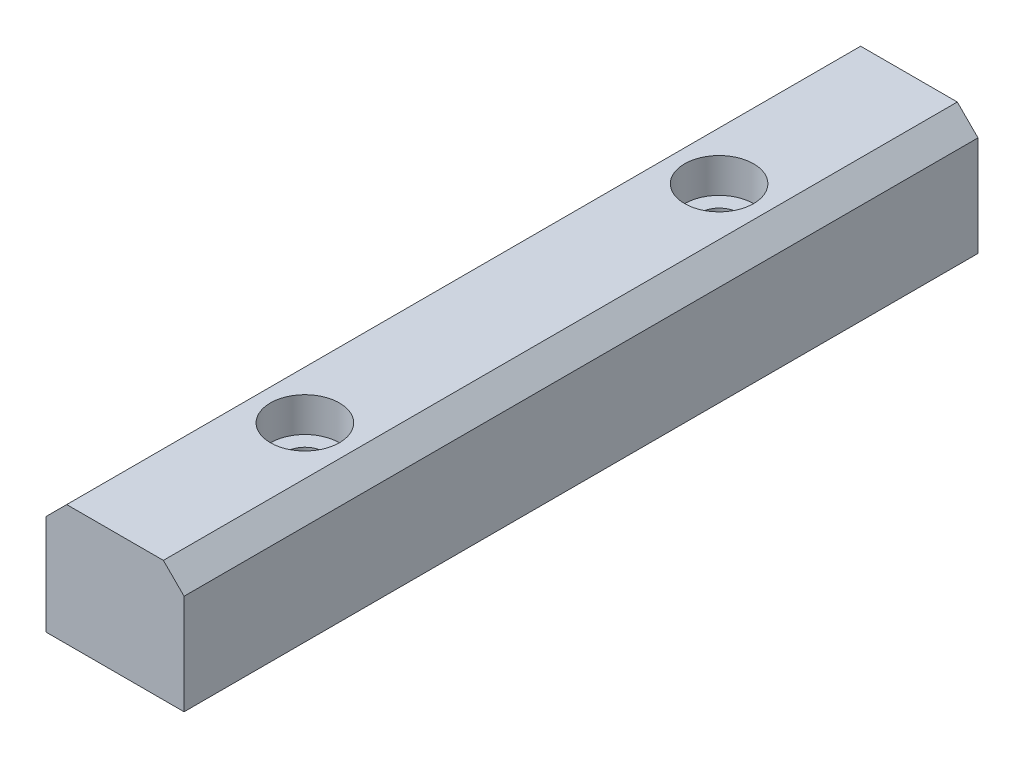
ISO-10303-21;
HEADER;
FILE_DESCRIPTION(('STEP AP214'),'2;1');
FILE_NAME('part.step','',(''),(''),'','','');
FILE_SCHEMA(('AUTOMOTIVE_DESIGN { 1 0 10303 214 1 1 1 1 }'));
ENDSEC;
DATA;
#1=APPLICATION_CONTEXT('core data for automotive mechanical design processes');
#2=APPLICATION_PROTOCOL_DEFINITION('international standard','automotive_design',2000,#1);
#3=PRODUCT_CONTEXT('',#1,'mechanical');
#4=PRODUCT('Part','Part','',(#3));
#5=PRODUCT_RELATED_PRODUCT_CATEGORY('part','',(#4));
#6=PRODUCT_DEFINITION_FORMATION('','',#4);
#7=PRODUCT_DEFINITION_CONTEXT('part definition',#1,'design');
#8=PRODUCT_DEFINITION('design','',#6,#7);
#9=PRODUCT_DEFINITION_SHAPE('','',#8);
#10=(LENGTH_UNIT() NAMED_UNIT(*) SI_UNIT(.MILLI.,.METRE.));
#11=(NAMED_UNIT(*) PLANE_ANGLE_UNIT() SI_UNIT($,.RADIAN.));
#12=(NAMED_UNIT(*) SI_UNIT($,.STERADIAN.) SOLID_ANGLE_UNIT());
#13=UNCERTAINTY_MEASURE_WITH_UNIT(LENGTH_MEASURE(1.E-05),#10,'distance_accuracy_value','');
#14=(GEOMETRIC_REPRESENTATION_CONTEXT(3) GLOBAL_UNCERTAINTY_ASSIGNED_CONTEXT((#13)) GLOBAL_UNIT_ASSIGNED_CONTEXT((#10,
#11,#12)) REPRESENTATION_CONTEXT('',''));
#15=CARTESIAN_POINT('',(0.,0.,0.));
#16=DIRECTION('',(0.,0.,1.));
#17=DIRECTION('',(1.,0.,0.));
#18=AXIS2_PLACEMENT_3D('',#15,#16,#17);
#19=CARTESIAN_POINT('',(-10.,17.5,-57.5));
#20=DIRECTION('',(1.,0.,0.));
#21=DIRECTION('',(0.,0.,-1.));
#22=AXIS2_PLACEMENT_3D('',#19,#20,#21);
#23=PLANE('',#22);
#24=DIRECTION('',(0.,-1.,0.));
#25=VECTOR('',#24,1.);
#26=CARTESIAN_POINT('',(-9.99999999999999,17.5,57.5));
#27=LINE('',#26,#25);
#28=CARTESIAN_POINT('',(-9.99999999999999,14.5,57.5));
#29=VERTEX_POINT('',#28);
#30=CARTESIAN_POINT('',(-9.99999999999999,0.,57.5));
#31=VERTEX_POINT('',#30);
#32=EDGE_CURVE('E83',#29,#31,#27,.T.);
#33=ORIENTED_EDGE('',*,*,#32,.F.);
#34=DIRECTION('',(0.,0.,-1.));
#35=VECTOR('',#34,1.);
#36=CARTESIAN_POINT('',(-10.,14.5,-57.5));
#37=LINE('',#36,#35);
#38=CARTESIAN_POINT('',(-10.,14.5,-57.5));
#39=VERTEX_POINT('',#38);
#40=EDGE_CURVE('E54',#29,#39,#37,.T.);
#41=ORIENTED_EDGE('',*,*,#40,.T.);
#42=DIRECTION('',(0.,-1.,0.));
#43=VECTOR('',#42,1.);
#44=CARTESIAN_POINT('',(-10.,17.5,-57.5));
#45=LINE('',#44,#43);
#46=CARTESIAN_POINT('',(-10.,0.,-57.5));
#47=VERTEX_POINT('',#46);
#48=EDGE_CURVE('E103',#39,#47,#45,.T.);
#49=ORIENTED_EDGE('',*,*,#48,.T.);
#50=DIRECTION('',(0.,0.,1.));
#51=VECTOR('',#50,1.);
#52=CARTESIAN_POINT('',(-10.,0.,-57.5));
#53=LINE('',#52,#51);
#54=EDGE_CURVE('E99',#47,#31,#53,.T.);
#55=ORIENTED_EDGE('',*,*,#54,.T.);
#56=EDGE_LOOP('',(#33,#41,#49,#55));
#57=FACE_BOUND('',#56,.T.);
#58=ADVANCED_FACE('F31',(#57),#23,.F.);
#59=CARTESIAN_POINT('',(-9.99999999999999,17.5,57.5));
#60=DIRECTION('',(0.,0.,-1.));
#61=DIRECTION('',(-1.,0.,0.));
#62=AXIS2_PLACEMENT_3D('',#59,#60,#61);
#63=PLANE('',#62);
#64=DIRECTION('',(1.,0.,0.));
#65=VECTOR('',#64,1.);
#66=CARTESIAN_POINT('',(-9.99999999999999,17.5,57.5));
#67=LINE('',#66,#65);
#68=CARTESIAN_POINT('',(-7.00000000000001,17.5,57.5));
#69=VERTEX_POINT('',#68);
#70=CARTESIAN_POINT('',(7.,17.5,57.5));
#71=VERTEX_POINT('',#70);
#72=EDGE_CURVE('E117',#69,#71,#67,.T.);
#73=ORIENTED_EDGE('',*,*,#72,.F.);
#74=DIRECTION('',(-0.707106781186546,-0.707106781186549,0.));
#75=VECTOR('',#74,1.);
#76=CARTESIAN_POINT('',(-7.00000000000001,17.5,57.5));
#77=LINE('',#76,#75);
#78=EDGE_CURVE('E90',#69,#29,#77,.T.);
#79=ORIENTED_EDGE('',*,*,#78,.T.);
#80=ORIENTED_EDGE('',*,*,#32,.T.);
#81=DIRECTION('',(1.,0.,0.));
#82=VECTOR('',#81,1.);
#83=CARTESIAN_POINT('',(-9.99999999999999,0.,57.5));
#84=LINE('',#83,#82);
#85=CARTESIAN_POINT('',(10.,0.,57.5));
#86=VERTEX_POINT('',#85);
#87=EDGE_CURVE('E88',#31,#86,#84,.T.);
#88=ORIENTED_EDGE('',*,*,#87,.T.);
#89=DIRECTION('',(0.,-1.,0.));
#90=VECTOR('',#89,1.);
#91=CARTESIAN_POINT('',(10.,17.5,57.5));
#92=LINE('',#91,#90);
#93=CARTESIAN_POINT('',(10.,14.5,57.5));
#94=VERTEX_POINT('',#93);
#95=EDGE_CURVE('E93',#94,#86,#92,.T.);
#96=ORIENTED_EDGE('',*,*,#95,.F.);
#97=DIRECTION('',(-0.707106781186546,0.707106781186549,0.));
#98=VECTOR('',#97,1.);
#99=CARTESIAN_POINT('',(7.,17.5,57.5));
#100=LINE('',#99,#98);
#101=EDGE_CURVE('E127',#94,#71,#100,.T.);
#102=ORIENTED_EDGE('',*,*,#101,.T.);
#103=EDGE_LOOP('',(#73,#79,#80,#88,#96,#102));
#104=FACE_BOUND('',#103,.T.);
#105=ADVANCED_FACE('F86',(#104),#63,.F.);
#106=CARTESIAN_POINT('',(9.99999999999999,17.5,-57.5));
#107=DIRECTION('',(-1.,0.,0.));
#108=DIRECTION('',(0.,0.,1.));
#109=AXIS2_PLACEMENT_3D('',#106,#107,#108);
#110=PLANE('',#109);
#111=DIRECTION('',(0.,-1.,0.));
#112=VECTOR('',#111,1.);
#113=CARTESIAN_POINT('',(9.99999999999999,17.5,-57.5));
#114=LINE('',#113,#112);
#115=CARTESIAN_POINT('',(9.99999999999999,14.5,-57.5));
#116=VERTEX_POINT('',#115);
#117=CARTESIAN_POINT('',(9.99999999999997,0.,-57.5));
#118=VERTEX_POINT('',#117);
#119=EDGE_CURVE('E119',#116,#118,#114,.T.);
#120=ORIENTED_EDGE('',*,*,#119,.F.);
#121=DIRECTION('',(0.,0.,1.));
#122=VECTOR('',#121,1.);
#123=CARTESIAN_POINT('',(10.,14.5,57.5));
#124=LINE('',#123,#122);
#125=EDGE_CURVE('E11',#116,#94,#124,.T.);
#126=ORIENTED_EDGE('',*,*,#125,.T.);
#127=ORIENTED_EDGE('',*,*,#95,.T.);
#128=DIRECTION('',(0.,0.,-1.));
#129=VECTOR('',#128,1.);
#130=CARTESIAN_POINT('',(9.99999999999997,0.,-57.5));
#131=LINE('',#130,#129);
#132=EDGE_CURVE('E101',#86,#118,#131,.T.);
#133=ORIENTED_EDGE('',*,*,#132,.T.);
#134=EDGE_LOOP('',(#120,#126,#127,#133));
#135=FACE_BOUND('',#134,.T.);
#136=ADVANCED_FACE('F156',(#135),#110,.F.);
#137=CARTESIAN_POINT('',(-10.,17.5,-57.5));
#138=DIRECTION('',(0.,0.,1.));
#139=DIRECTION('',(1.,0.,0.));
#140=AXIS2_PLACEMENT_3D('',#137,#138,#139);
#141=PLANE('',#140);
#142=ORIENTED_EDGE('',*,*,#48,.F.);
#143=DIRECTION('',(0.707106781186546,0.707106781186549,0.));
#144=VECTOR('',#143,1.);
#145=CARTESIAN_POINT('',(-7.00000000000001,17.5,-57.5));
#146=LINE('',#145,#144);
#147=CARTESIAN_POINT('',(-7.00000000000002,17.5,-57.5));
#148=VERTEX_POINT('',#147);
#149=EDGE_CURVE('E39',#39,#148,#146,.T.);
#150=ORIENTED_EDGE('',*,*,#149,.T.);
#151=DIRECTION('',(-1.,0.,0.));
#152=VECTOR('',#151,1.);
#153=CARTESIAN_POINT('',(-10.,17.5,-57.5));
#154=LINE('',#153,#152);
#155=CARTESIAN_POINT('',(6.99999999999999,17.5,-57.5));
#156=VERTEX_POINT('',#155);
#157=EDGE_CURVE('E111',#156,#148,#154,.T.);
#158=ORIENTED_EDGE('',*,*,#157,.F.);
#159=DIRECTION('',(0.707106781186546,-0.707106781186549,0.));
#160=VECTOR('',#159,1.);
#161=CARTESIAN_POINT('',(7.,17.5,-57.5));
#162=LINE('',#161,#160);
#163=EDGE_CURVE('E46',#156,#116,#162,.T.);
#164=ORIENTED_EDGE('',*,*,#163,.T.);
#165=ORIENTED_EDGE('',*,*,#119,.T.);
#166=DIRECTION('',(-1.,0.,0.));
#167=VECTOR('',#166,1.);
#168=CARTESIAN_POINT('',(-10.,0.,-57.5));
#169=LINE('',#168,#167);
#170=EDGE_CURVE('E115',#118,#47,#169,.T.);
#171=ORIENTED_EDGE('',*,*,#170,.T.);
#172=EDGE_LOOP('',(#142,#150,#158,#164,#165,#171));
#173=FACE_BOUND('',#172,.T.);
#174=ADVANCED_FACE('F133',(#173),#141,.F.);
#175=CARTESIAN_POINT('',(-9.99999999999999,17.5,57.5));
#176=DIRECTION('',(0.,1.,0.));
#177=DIRECTION('',(0.,0.,1.));
#178=AXIS2_PLACEMENT_3D('',#175,#176,#177);
#179=PLANE('',#178);
#180=CARTESIAN_POINT('',(0.,17.5,30.));
#181=DIRECTION('',(0.,1.,0.));
#182=DIRECTION('',(0.,0.,1.));
#183=AXIS2_PLACEMENT_3D('',#180,#181,#182);
#184=CIRCLE('',#183,4.99999999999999);
#185=CARTESIAN_POINT('',(0.,17.5,35.));
#186=VERTEX_POINT('',#185);
#187=EDGE_CURVE('E197',#186,#186,#184,.T.);
#188=ORIENTED_EDGE('',*,*,#187,.F.);
#189=EDGE_LOOP('',(#188));
#190=FACE_BOUND('',#189,.T.);
#191=CARTESIAN_POINT('',(0.,17.5,-30.));
#192=DIRECTION('',(0.,1.,0.));
#193=DIRECTION('',(0.,0.,1.));
#194=AXIS2_PLACEMENT_3D('',#191,#192,#193);
#195=CIRCLE('',#194,4.99999999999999);
#196=CARTESIAN_POINT('',(0.,17.5,-25.));
#197=VERTEX_POINT('',#196);
#198=EDGE_CURVE('E206',#197,#197,#195,.T.);
#199=ORIENTED_EDGE('',*,*,#198,.F.);
#200=EDGE_LOOP('',(#199));
#201=FACE_BOUND('',#200,.T.);
#202=ORIENTED_EDGE('',*,*,#157,.T.);
#203=DIRECTION('',(0.,0.,1.));
#204=VECTOR('',#203,1.);
#205=CARTESIAN_POINT('',(-7.00000000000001,17.5,57.5));
#206=LINE('',#205,#204);
#207=EDGE_CURVE('E124',#148,#69,#206,.T.);
#208=ORIENTED_EDGE('',*,*,#207,.T.);
#209=ORIENTED_EDGE('',*,*,#72,.T.);
#210=DIRECTION('',(0.,0.,-1.));
#211=VECTOR('',#210,1.);
#212=CARTESIAN_POINT('',(6.99999999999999,17.5,-57.5));
#213=LINE('',#212,#211);
#214=EDGE_CURVE('E92',#71,#156,#213,.T.);
#215=ORIENTED_EDGE('',*,*,#214,.T.);
#216=EDGE_LOOP('',(#202,#208,#209,#215));
#217=FACE_BOUND('',#216,.T.);
#218=ADVANCED_FACE('F137',(#190,#201,#217),#179,.T.);
#219=CARTESIAN_POINT('',(-9.99999999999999,0.,57.5));
#220=DIRECTION('',(0.,1.,0.));
#221=DIRECTION('',(0.,0.,1.));
#222=AXIS2_PLACEMENT_3D('',#219,#220,#221);
#223=PLANE('',#222);
#224=CARTESIAN_POINT('',(0.,0.,30.));
#225=DIRECTION('',(0.,1.,0.));
#226=DIRECTION('',(0.,0.,1.));
#227=AXIS2_PLACEMENT_3D('',#224,#225,#226);
#228=CIRCLE('',#227,2.75);
#229=CARTESIAN_POINT('',(0.,0.,32.75));
#230=VERTEX_POINT('',#229);
#231=EDGE_CURVE('E199',#230,#230,#228,.T.);
#232=ORIENTED_EDGE('',*,*,#231,.T.);
#233=EDGE_LOOP('',(#232));
#234=FACE_BOUND('',#233,.T.);
#235=CARTESIAN_POINT('',(0.,0.,-30.));
#236=DIRECTION('',(0.,1.,0.));
#237=DIRECTION('',(0.,0.,1.));
#238=AXIS2_PLACEMENT_3D('',#235,#236,#237);
#239=CIRCLE('',#238,2.75);
#240=CARTESIAN_POINT('',(0.,0.,-27.25));
#241=VERTEX_POINT('',#240);
#242=EDGE_CURVE('E105',#241,#241,#239,.T.);
#243=ORIENTED_EDGE('',*,*,#242,.T.);
#244=EDGE_LOOP('',(#243));
#245=FACE_BOUND('',#244,.T.);
#246=ORIENTED_EDGE('',*,*,#54,.F.);
#247=ORIENTED_EDGE('',*,*,#170,.F.);
#248=ORIENTED_EDGE('',*,*,#132,.F.);
#249=ORIENTED_EDGE('',*,*,#87,.F.);
#250=EDGE_LOOP('',(#246,#247,#248,#249));
#251=FACE_BOUND('',#250,.T.);
#252=ADVANCED_FACE('F97',(#234,#245,#251),#223,.F.);
#253=CARTESIAN_POINT('',(0.,17.5,-30.));
#254=DIRECTION('',(0.,1.,0.));
#255=DIRECTION('',(0.,0.,1.));
#256=AXIS2_PLACEMENT_3D('',#253,#254,#255);
#257=CYLINDRICAL_SURFACE('',#256,2.75);
#258=ORIENTED_EDGE('',*,*,#242,.F.);
#259=EDGE_LOOP('',(#258));
#260=FACE_BOUND('',#259,.T.);
#261=CARTESIAN_POINT('',(0.,12.5,-30.));
#262=DIRECTION('',(0.,1.,0.));
#263=DIRECTION('',(0.,0.,1.));
#264=AXIS2_PLACEMENT_3D('',#261,#262,#263);
#265=CIRCLE('',#264,2.75);
#266=CARTESIAN_POINT('',(0.,12.5,-27.25));
#267=VERTEX_POINT('',#266);
#268=EDGE_CURVE('E108',#267,#267,#265,.T.);
#269=ORIENTED_EDGE('',*,*,#268,.T.);
#270=EDGE_LOOP('',(#269));
#271=FACE_BOUND('',#270,.T.);
#272=ADVANCED_FACE('F166',(#260,#271),#257,.F.);
#273=CARTESIAN_POINT('',(2.75,12.5,-30.));
#274=DIRECTION('',(0.,-1.,0.));
#275=DIRECTION('',(0.,0.,-1.));
#276=AXIS2_PLACEMENT_3D('',#273,#274,#275);
#277=PLANE('',#276);
#278=ORIENTED_EDGE('',*,*,#268,.F.);
#279=EDGE_LOOP('',(#278));
#280=FACE_BOUND('',#279,.T.);
#281=CARTESIAN_POINT('',(0.,12.5,-30.));
#282=DIRECTION('',(0.,1.,0.));
#283=DIRECTION('',(0.,0.,1.));
#284=AXIS2_PLACEMENT_3D('',#281,#282,#283);
#285=CIRCLE('',#284,5.);
#286=CARTESIAN_POINT('',(0.,12.5,-25.));
#287=VERTEX_POINT('',#286);
#288=EDGE_CURVE('E209',#287,#287,#285,.T.);
#289=ORIENTED_EDGE('',*,*,#288,.T.);
#290=EDGE_LOOP('',(#289));
#291=FACE_BOUND('',#290,.T.);
#292=ADVANCED_FACE('F173',(#280,#291),#277,.F.);
#293=CARTESIAN_POINT('',(0.,17.5,-30.));
#294=DIRECTION('',(0.,1.,0.));
#295=DIRECTION('',(0.,0.,1.));
#296=AXIS2_PLACEMENT_3D('',#293,#294,#295);
#297=CYLINDRICAL_SURFACE('',#296,5.);
#298=ORIENTED_EDGE('',*,*,#288,.F.);
#299=EDGE_LOOP('',(#298));
#300=FACE_BOUND('',#299,.T.);
#301=ORIENTED_EDGE('',*,*,#198,.T.);
#302=EDGE_LOOP('',(#301));
#303=FACE_BOUND('',#302,.T.);
#304=ADVANCED_FACE('F177',(#300,#303),#297,.F.);
#305=CARTESIAN_POINT('',(0.,17.5,30.));
#306=DIRECTION('',(0.,1.,0.));
#307=DIRECTION('',(0.,0.,1.));
#308=AXIS2_PLACEMENT_3D('',#305,#306,#307);
#309=CYLINDRICAL_SURFACE('',#308,2.75);
#310=ORIENTED_EDGE('',*,*,#231,.F.);
#311=EDGE_LOOP('',(#310));
#312=FACE_BOUND('',#311,.T.);
#313=CARTESIAN_POINT('',(0.,12.5,30.));
#314=DIRECTION('',(0.,1.,0.));
#315=DIRECTION('',(0.,0.,1.));
#316=AXIS2_PLACEMENT_3D('',#313,#314,#315);
#317=CIRCLE('',#316,2.75);
#318=CARTESIAN_POINT('',(0.,12.5,32.75));
#319=VERTEX_POINT('',#318);
#320=EDGE_CURVE('E193',#319,#319,#317,.T.);
#321=ORIENTED_EDGE('',*,*,#320,.T.);
#322=EDGE_LOOP('',(#321));
#323=FACE_BOUND('',#322,.T.);
#324=ADVANCED_FACE('F181',(#312,#323),#309,.F.);
#325=CARTESIAN_POINT('',(2.75,12.5,30.));
#326=DIRECTION('',(0.,-1.,0.));
#327=DIRECTION('',(0.,0.,-1.));
#328=AXIS2_PLACEMENT_3D('',#325,#326,#327);
#329=PLANE('',#328);
#330=ORIENTED_EDGE('',*,*,#320,.F.);
#331=EDGE_LOOP('',(#330));
#332=FACE_BOUND('',#331,.T.);
#333=CARTESIAN_POINT('',(0.,12.5,30.));
#334=DIRECTION('',(0.,1.,0.));
#335=DIRECTION('',(0.,0.,1.));
#336=AXIS2_PLACEMENT_3D('',#333,#334,#335);
#337=CIRCLE('',#336,5.);
#338=CARTESIAN_POINT('',(0.,12.5,35.));
#339=VERTEX_POINT('',#338);
#340=EDGE_CURVE('E196',#339,#339,#337,.T.);
#341=ORIENTED_EDGE('',*,*,#340,.T.);
#342=EDGE_LOOP('',(#341));
#343=FACE_BOUND('',#342,.T.);
#344=ADVANCED_FACE('F148',(#332,#343),#329,.F.);
#345=CARTESIAN_POINT('',(0.,17.5,30.));
#346=DIRECTION('',(0.,1.,0.));
#347=DIRECTION('',(0.,0.,1.));
#348=AXIS2_PLACEMENT_3D('',#345,#346,#347);
#349=CYLINDRICAL_SURFACE('',#348,5.);
#350=ORIENTED_EDGE('',*,*,#340,.F.);
#351=EDGE_LOOP('',(#350));
#352=FACE_BOUND('',#351,.T.);
#353=ORIENTED_EDGE('',*,*,#187,.T.);
#354=EDGE_LOOP('',(#353));
#355=FACE_BOUND('',#354,.T.);
#356=ADVANCED_FACE('F142',(#352,#355),#349,.F.);
#357=CARTESIAN_POINT('',(-7.00000000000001,17.5,57.5));
#358=DIRECTION('',(-0.707106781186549,0.707106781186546,0.));
#359=DIRECTION('',(-0.707106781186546,-0.707106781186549,0.));
#360=AXIS2_PLACEMENT_3D('',#357,#358,#359);
#361=PLANE('',#360);
#362=ORIENTED_EDGE('',*,*,#149,.F.);
#363=ORIENTED_EDGE('',*,*,#40,.F.);
#364=ORIENTED_EDGE('',*,*,#78,.F.);
#365=ORIENTED_EDGE('',*,*,#207,.F.);
#366=EDGE_LOOP('',(#362,#363,#364,#365));
#367=FACE_BOUND('',#366,.T.);
#368=ADVANCED_FACE('F140',(#367),#361,.T.);
#369=CARTESIAN_POINT('',(7.,17.5,57.5));
#370=DIRECTION('',(0.707106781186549,0.707106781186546,0.));
#371=DIRECTION('',(-0.707106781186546,0.707106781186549,0.));
#372=AXIS2_PLACEMENT_3D('',#369,#370,#371);
#373=PLANE('',#372);
#374=ORIENTED_EDGE('',*,*,#101,.F.);
#375=ORIENTED_EDGE('',*,*,#125,.F.);
#376=ORIENTED_EDGE('',*,*,#163,.F.);
#377=ORIENTED_EDGE('',*,*,#214,.F.);
#378=EDGE_LOOP('',(#374,#375,#376,#377));
#379=FACE_BOUND('',#378,.T.);
#380=ADVANCED_FACE('F33',(#379),#373,.T.);
#381=CLOSED_SHELL('',(#58,#105,#136,#174,#218,#252,#272,#292,#304,#324,#344,#356,#368,#380));
#382=MANIFOLD_SOLID_BREP('B2',#381);
#383=ADVANCED_BREP_SHAPE_REPRESENTATION('',(#18,#382),#14);
#384=SHAPE_DEFINITION_REPRESENTATION(#9,#383);
ENDSEC;
END-ISO-10303-21;
